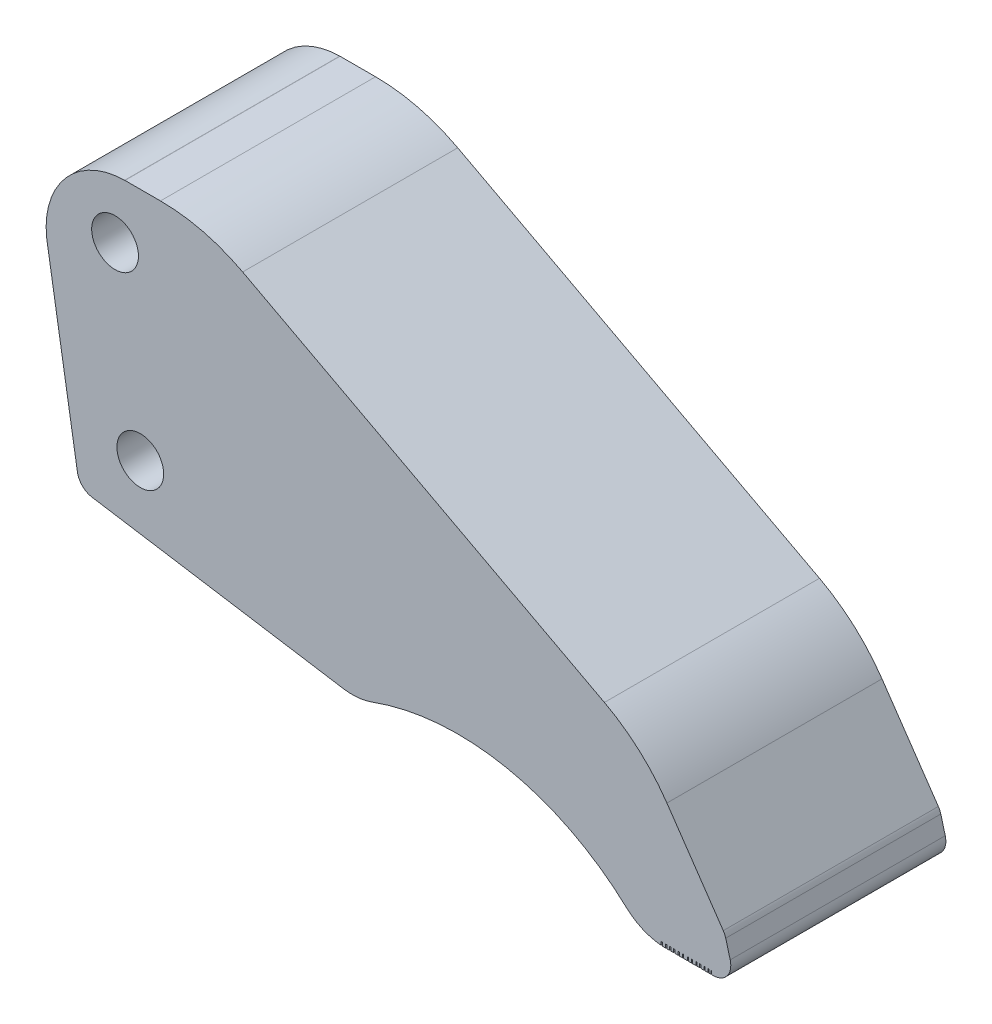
from build123d import *

# Parameters (mm, degrees)
SKETCH1_R           = 4
SKETCH1_W           = 0.443674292
SKETCH1_H           = 0.606573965
SKETCH1_W_2         = 0.441272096
SKETCH1_W_3         = 0.539332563
SKETCH1_W_4         = 0.547504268
SKETCH1_W_5         = 0.686423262
SKETCH1_W_6         = 0.547504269
SKETCH1_W_7         = 0.607984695
SKETCH1_W_8         = 0.472854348
SKETCH1_W_9         = 0.501804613
SKETCH1_W_10        = 0.559705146
SKETCH1_W_11        = 0.321886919
SKETCH1_W_12        = 0.335329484
BOSS_EXTRUDE1_DEPTH = 36.8
SKETCH2_W           = 33.453118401
SKETCH2_H           = 26.8
CUT_EXTRUDE1_DEPTH  = 45


with BuildPart() as part:
    # Sketch1 → Boss-Extrude1 (new body)
    # profile 1 of 15: a face of its own
    with BuildSketch(Plane.XY):
        with BuildLine():
            ThreePointArc((-2.487228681, 2.47588145), (-1.643417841, 0.836304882), (0, 0))
            Line((0, 0), (42.98, -6.863043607))
            ThreePointArc((42.98, -6.863043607), (45.517837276, -6.94186018), (47.993719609, -6.378977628))
            ThreePointArc((47.993719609, -6.378977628), (70.945368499, -4.618817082), (91.44683801, -15.086199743))
            ThreePointArc((91.44683801, -15.086199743), (93.970071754, -16.788756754), (96.888617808, -17.653336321))
            Line((96.888617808, -17.653336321), (96.888617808, -17.138033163))
            Line((96.888617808, -17.138033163), (97.372163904, -17.138033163))
            Line((97.372163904, -17.138033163), (97.653484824, -17.138033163))
            Line((97.653484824, -17.138033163), (98.160101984, -17.138033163))
            Line((98.160101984, -17.138033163), (98.378364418, -17.138033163))
            Line((98.378364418, -17.138033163), (98.82203871, -17.138033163))
            Line((98.82203871, -17.138033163), (99.050846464, -17.138033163))
            Line((99.050846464, -17.138033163), (99.49211856, -17.138033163))
            Line((99.49211856, -17.138033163), (99.769956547, -17.138033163))
            Line((99.769956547, -17.138033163), (100.30928911, -17.138033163))
            Line((100.30928911, -17.138033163), (100.521753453, -17.138033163))
            Line((100.521753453, -17.138033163), (101.069257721, -17.138033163))
            Line((101.069257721, -17.138033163), (101.191833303, -17.138033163))
            Line((101.191833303, -17.138033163), (101.878256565, -17.138033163))
            Line((101.878256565, -17.138033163), (102.04986238, -17.138033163))
            Line((102.04986238, -17.138033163), (102.597366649, -17.138033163))
            Line((102.597366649, -17.138033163), (102.713161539, -17.138033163))
            Line((102.713161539, -17.138033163), (103.321146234, -17.138033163))
            Line((103.321146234, -17.138033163), (103.504651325, -17.138033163))
            Line((103.504651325, -17.138033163), (103.977505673, -17.138033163))
            Line((103.977505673, -17.138033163), (104.180157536, -17.138033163))
            Line((104.180157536, -17.138033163), (104.681962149, -17.138033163))
            Line((104.681962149, -17.138033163), (104.855663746, -17.138033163))
            Line((104.855663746, -17.138033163), (105.415368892, -17.138033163))
            Line((105.415368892, -17.138033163), (105.543243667, -17.138033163))
            Line((105.543243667, -17.138033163), (105.878573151, -17.138033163))
            Line((105.878573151, -17.138033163), (105.984724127, -17.138033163))
            Line((105.984724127, -17.138033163), (106.306611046, -17.138033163))
            Line((106.306611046, -17.138033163), (106.306611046, -17.744607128))
            ThreePointArc((106.306611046, -17.744607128), (108.688292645, -16.568776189), (109.203004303, -13.963002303))
            Line((109.203004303, -13.963002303), (108.439636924, -11.134191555))
            ThreePointArc((108.439636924, -11.134191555), (108.267803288, -10.660099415), (108.018988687, -10.221486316))
            Line((108.018988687, -10.221486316), (98.378364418, 3.865502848))
            ThreePointArc((98.378364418, 3.865502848), (93.609207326, 9.293547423), (87.68053985, 13.423853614))
            Line((87.68053985, 13.423853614), (25.781983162, 46.262452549))
            ThreePointArc((25.781983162, 46.262452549), (18.966543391, 48.873228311), (11.72235753, 49.761001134))
            Line((11.72235753, 49.761001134), (5.64235753, 49.761001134))
            ThreePointArc((5.64235753, 49.761001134), (5.616565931, 49.760890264), (5.590776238, 49.760557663))
            ThreePointArc((5.590776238, 49.760557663), (1.019670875, 48.889839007), (-2.994529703, 46.536256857))
            ThreePointArc((-2.994529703, 46.536256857), (-6.872179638, 41.155169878), (-7.760495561, 34.582258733))
            ThreePointArc((-7.760495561, 34.582258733), (-7.750828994, 34.504551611), (-7.739137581, 34.427123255))
            Line((-7.739137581, 34.427123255), (-2.487228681, 2.47588145))
        make_face()
        with Locations((8.267526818, 9.561727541)):
            Circle(SKETCH1_R, mode=Mode.SUBTRACT)
        with Locations((3.948380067, 39.69588145)):
            Circle(SKETCH1_R, mode=Mode.SUBTRACT)
    # profile 2 of 15: a face of its own
    with BuildSketch(Plane.XY):
        with BuildLine():
            Line((96.888617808, -17.138033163), (96.888617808, -17.653336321))
            ThreePointArc((96.888617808, -17.653336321), (97.130063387, -17.683196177), (97.372163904, -17.707173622))
            Line((97.372163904, -17.707173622), (97.372163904, -17.138033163))
            Line((97.372163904, -17.138033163), (96.888617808, -17.138033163))
        make_face()
    # profile 3 of 15: a face of its own
    with BuildSketch(Plane.XY):
        with BuildLine():
            Line((97.653484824, -17.138033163), (97.653484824, -17.727590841))
            ThreePointArc((97.653484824, -17.727590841), (97.906687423, -17.739163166), (98.160101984, -17.744314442))
            Line((98.160101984, -17.744314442), (98.160101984, -17.138033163))
            Line((98.160101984, -17.138033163), (97.653484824, -17.138033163))
        make_face()
    # profile 4 of 15: a face of its own
    with BuildSketch(Plane.XY):
        with Locations((98.600201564, -17.441320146)):
            Rectangle(SKETCH1_W, SKETCH1_H)
    # profile 5 of 15: a face of its own
    with BuildSketch(Plane.XY):
        with Locations((99.271482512, -17.441320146)):
            Rectangle(SKETCH1_W_2, SKETCH1_H)
    # profile 6 of 15: a face of its own
    with BuildSketch(Plane.XY):
        with Locations((100.039622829, -17.441320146)):
            Rectangle(SKETCH1_W_3, SKETCH1_H)
    # profile 7 of 15: a face of its own
    with BuildSketch(Plane.XY):
        with Locations((100.795505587, -17.441320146)):
            Rectangle(SKETCH1_W_4, SKETCH1_H)
    # profile 8 of 15: a face of its own
    with BuildSketch(Plane.XY):
        with Locations((101.535044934, -17.441320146)):
            Rectangle(SKETCH1_W_5, SKETCH1_H)
    # profile 9 of 15: a face of its own
    with BuildSketch(Plane.XY):
        with Locations((102.323614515, -17.441320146)):
            Rectangle(SKETCH1_W_6, SKETCH1_H)
    # profile 10 of 15: a face of its own
    with BuildSketch(Plane.XY):
        with Locations((103.017153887, -17.441320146)):
            Rectangle(SKETCH1_W_7, SKETCH1_H)
    # profile 11 of 15: a face of its own
    with BuildSketch(Plane.XY):
        with Locations((103.741078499, -17.441320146)):
            Rectangle(SKETCH1_W_8, SKETCH1_H)
    # profile 12 of 15: a face of its own
    with BuildSketch(Plane.XY):
        with Locations((104.431059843, -17.441320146)):
            Rectangle(SKETCH1_W_9, SKETCH1_H)
    # profile 13 of 15: a face of its own
    with BuildSketch(Plane.XY):
        with Locations((105.135516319, -17.441320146)):
            Rectangle(SKETCH1_W_10, SKETCH1_H)
    # profile 14 of 15: a face of its own
    with BuildSketch(Plane.XY):
        with Locations((106.145667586, -17.441320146)):
            Rectangle(SKETCH1_W_11, SKETCH1_H)
    # profile 15 of 15: a face of its own
    with BuildSketch(Plane.XY):
        with Locations((105.710908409, -17.441320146)):
            Rectangle(SKETCH1_W_12, SKETCH1_H)
    extrude(amount=BOSS_EXTRUDE1_DEPTH)

    # Sketch2 → Cut-Extrude1 (cut)
    with BuildSketch(Plane(origin=(0, -40, 0), x_dir=(1, 0, 0), z_dir=(0, 1, 0))):
        with Locations((69.72027881, -18.4)):
            Rectangle(SKETCH2_W, SKETCH2_H)
    extrude(amount=CUT_EXTRUDE1_DEPTH, mode=Mode.SUBTRACT)


solid = part.part
